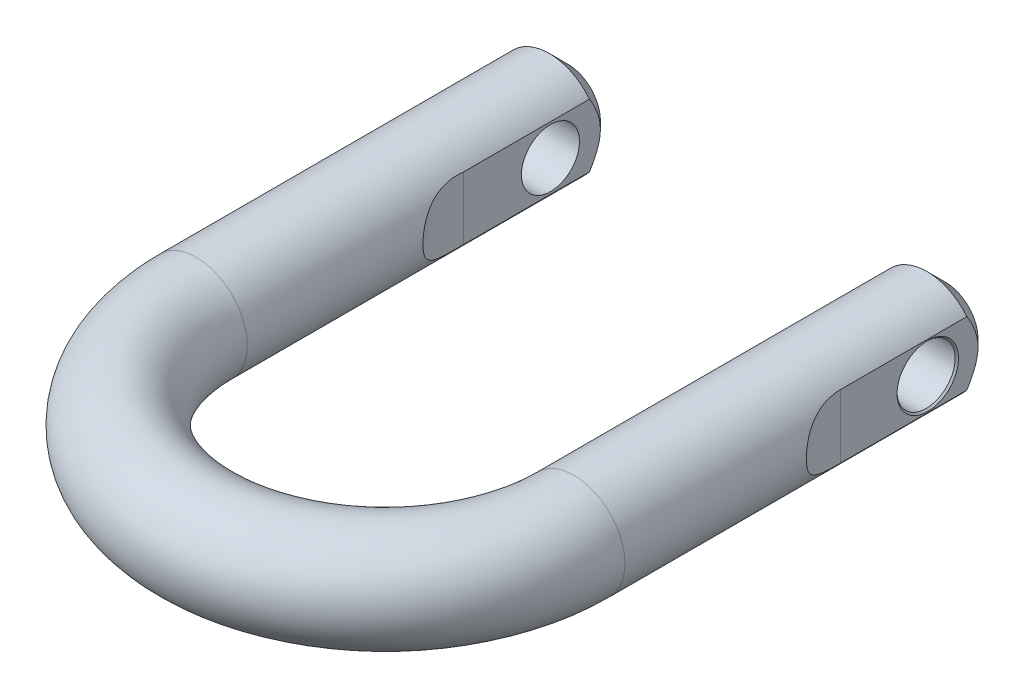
ISO-10303-21;
HEADER;
FILE_DESCRIPTION(('STEP AP214'),'2;1');
FILE_NAME('part.step','',(''),(''),'','','');
FILE_SCHEMA(('AUTOMOTIVE_DESIGN { 1 0 10303 214 1 1 1 1 }'));
ENDSEC;
DATA;
#1=APPLICATION_CONTEXT('core data for automotive mechanical design processes');
#2=APPLICATION_PROTOCOL_DEFINITION('international standard','automotive_design',2000,#1);
#3=PRODUCT_CONTEXT('',#1,'mechanical');
#4=PRODUCT('Part','Part','',(#3));
#5=PRODUCT_RELATED_PRODUCT_CATEGORY('part','',(#4));
#6=PRODUCT_DEFINITION_FORMATION('','',#4);
#7=PRODUCT_DEFINITION_CONTEXT('part definition',#1,'design');
#8=PRODUCT_DEFINITION('design','',#6,#7);
#9=PRODUCT_DEFINITION_SHAPE('','',#8);
#10=(LENGTH_UNIT() NAMED_UNIT(*) SI_UNIT(.MILLI.,.METRE.));
#11=(NAMED_UNIT(*) PLANE_ANGLE_UNIT() SI_UNIT($,.RADIAN.));
#12=(NAMED_UNIT(*) SI_UNIT($,.STERADIAN.) SOLID_ANGLE_UNIT());
#13=UNCERTAINTY_MEASURE_WITH_UNIT(LENGTH_MEASURE(1.E-05),#10,'distance_accuracy_value','');
#14=(GEOMETRIC_REPRESENTATION_CONTEXT(3) GLOBAL_UNCERTAINTY_ASSIGNED_CONTEXT((#13)) GLOBAL_UNIT_ASSIGNED_CONTEXT((#10,
#11,#12)) REPRESENTATION_CONTEXT('',''));
#15=CARTESIAN_POINT('',(0.,0.,0.));
#16=DIRECTION('',(0.,0.,1.));
#17=DIRECTION('',(1.,0.,0.));
#18=AXIS2_PLACEMENT_3D('',#15,#16,#17);
#19=CARTESIAN_POINT('',(59.0296,0.,0.));
#20=DIRECTION('',(1.,0.,0.));
#21=DIRECTION('',(0.,0.,1.));
#22=AXIS2_PLACEMENT_3D('',#19,#20,#21);
#23=CONICAL_SURFACE('',#22,7.9375,0.785398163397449);
#24=CARTESIAN_POINT('',(58.5921,0.,0.));
#25=DIRECTION('',(1.,0.,0.));
#26=DIRECTION('',(0.,0.,1.));
#27=AXIS2_PLACEMENT_3D('',#24,#25,#26);
#28=CIRCLE('',#27,7.5);
#29=CARTESIAN_POINT('',(58.5921,0.,7.5));
#30=VERTEX_POINT('',#29);
#31=EDGE_CURVE('E271',#30,#30,#28,.F.);
#32=ORIENTED_EDGE('',*,*,#31,.T.);
#33=EDGE_LOOP('',(#32));
#34=FACE_BOUND('',#33,.T.);
#35=CARTESIAN_POINT('',(59.0296,0.,0.));
#36=DIRECTION('',(1.,0.,0.));
#37=DIRECTION('',(0.,0.,1.));
#38=AXIS2_PLACEMENT_3D('',#35,#36,#37);
#39=CIRCLE('',#38,7.9375);
#40=CARTESIAN_POINT('',(59.0296,0.,7.9375));
#41=VERTEX_POINT('',#40);
#42=EDGE_CURVE('E139',#41,#41,#39,.T.);
#43=ORIENTED_EDGE('',*,*,#42,.T.);
#44=EDGE_LOOP('',(#43));
#45=FACE_BOUND('',#44,.T.);
#46=ADVANCED_FACE('F14',(#34,#45),#23,.F.);
#47=CARTESIAN_POINT('',(48.7426,0.,-14.83995));
#48=DIRECTION('',(0.,0.,1.));
#49=DIRECTION('',(0.,-1.,0.));
#50=AXIS2_PLACEMENT_3D('',#47,#48,#49);
#51=PLANE('',#50);
#52=CARTESIAN_POINT('',(48.7426,0.,-14.83995));
#53=DIRECTION('',(0.,0.,1.));
#54=DIRECTION('',(-1.,0.,0.));
#55=AXIS2_PLACEMENT_3D('',#52,#53,#54);
#56=CIRCLE('',#55,8.4074);
#57=CARTESIAN_POINT('',(40.3352,0.,-14.83995));
#58=VERTEX_POINT('',#57);
#59=EDGE_CURVE('E136',#58,#58,#56,.T.);
#60=ORIENTED_EDGE('',*,*,#59,.F.);
#61=EDGE_LOOP('',(#60));
#62=FACE_BOUND('',#61,.T.);
#63=ADVANCED_FACE('F239',(#62),#51,.F.);
#64=CARTESIAN_POINT('',(-48.7426,0.,-14.83995));
#65=DIRECTION('',(0.,0.,-1.));
#66=DIRECTION('',(1.,0.,0.));
#67=AXIS2_PLACEMENT_3D('',#64,#65,#66);
#68=PLANE('',#67);
#69=CARTESIAN_POINT('',(-48.7426,0.,-14.83995));
#70=DIRECTION('',(0.,0.,1.));
#71=DIRECTION('',(0.,-1.,0.));
#72=AXIS2_PLACEMENT_3D('',#69,#70,#71);
#73=CIRCLE('',#72,8.4074);
#74=CARTESIAN_POINT('',(-48.7426,-8.4074,-14.83995));
#75=VERTEX_POINT('',#74);
#76=EDGE_CURVE('E438',#75,#75,#73,.T.);
#77=ORIENTED_EDGE('',*,*,#76,.F.);
#78=EDGE_LOOP('',(#77));
#79=FACE_BOUND('',#78,.T.);
#80=ADVANCED_FACE('F236',(#79),#68,.T.);
#81=CARTESIAN_POINT('',(-59.0296,0.,0.));
#82=DIRECTION('',(-1.,0.,0.));
#83=DIRECTION('',(0.,0.,-1.));
#84=AXIS2_PLACEMENT_3D('',#81,#82,#83);
#85=CONICAL_SURFACE('',#84,7.9375,0.785398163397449);
#86=CARTESIAN_POINT('',(-58.5921,0.,0.));
#87=DIRECTION('',(-1.,0.,0.));
#88=DIRECTION('',(0.,0.,-1.));
#89=AXIS2_PLACEMENT_3D('',#86,#87,#88);
#90=CIRCLE('',#89,7.5);
#91=CARTESIAN_POINT('',(-58.5921,0.,-7.49999999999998));
#92=VERTEX_POINT('',#91);
#93=EDGE_CURVE('E270',#92,#92,#90,.F.);
#94=ORIENTED_EDGE('',*,*,#93,.T.);
#95=EDGE_LOOP('',(#94));
#96=FACE_BOUND('',#95,.T.);
#97=CARTESIAN_POINT('',(-59.0296,0.,0.));
#98=DIRECTION('',(-1.,0.,0.));
#99=DIRECTION('',(0.,0.,-1.));
#100=AXIS2_PLACEMENT_3D('',#97,#98,#99);
#101=CIRCLE('',#100,7.9375);
#102=CARTESIAN_POINT('',(-59.0296,0.,-7.93749999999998));
#103=VERTEX_POINT('',#102);
#104=EDGE_CURVE('E116',#103,#103,#101,.T.);
#105=ORIENTED_EDGE('',*,*,#104,.T.);
#106=EDGE_LOOP('',(#105));
#107=FACE_BOUND('',#106,.T.);
#108=ADVANCED_FACE('F232',(#96,#107),#85,.F.);
#109=CARTESIAN_POINT('',(84.4296,25.4,22.49805));
#110=DIRECTION('',(0.,-1.,0.));
#111=DIRECTION('',(1.,0.,0.));
#112=AXIS2_PLACEMENT_3D('',#109,#110,#111);
#113=CYLINDRICAL_SURFACE('',#112,25.4);
#114=DIRECTION('',(0.,-1.,0.));
#115=VECTOR('',#114,1.);
#116=CARTESIAN_POINT('',(59.0296,25.4,22.49805));
#117=LINE('',#116,#115);
#118=CARTESIAN_POINT('',(59.0296,-8.22337503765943,22.49805));
#119=VERTEX_POINT('',#118);
#120=CARTESIAN_POINT('',(59.0296,8.22337503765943,22.49805));
#121=VERTEX_POINT('',#120);
#122=EDGE_CURVE('E137',#119,#121,#117,.F.);
#123=ORIENTED_EDGE('',*,*,#122,.T.);
#124=CARTESIAN_POINT('',(59.0296,-8.22337503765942,22.49805));
#125=CARTESIAN_POINT('',(59.0295964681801,-8.22336756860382,22.7016537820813));
#126=CARTESIAN_POINT('',(59.0320480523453,-8.22031233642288,22.9052572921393));
#127=CARTESIAN_POINT('',(59.0418354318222,-8.20805265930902,23.3121642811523));
#128=CARTESIAN_POINT('',(59.0491712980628,-8.1988481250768,23.5154677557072));
#129=CARTESIAN_POINT('',(59.0687103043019,-8.17422470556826,23.9216581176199));
#130=CARTESIAN_POINT('',(59.0809179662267,-8.15880004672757,24.124544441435));
#131=CARTESIAN_POINT('',(59.1101429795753,-8.12162950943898,24.5293807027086));
#132=CARTESIAN_POINT('',(59.1271604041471,-8.09988353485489,24.7313306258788));
#133=CARTESIAN_POINT('',(59.185664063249,-8.0245164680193,25.338831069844));
#134=CARTESIAN_POINT('',(59.2344321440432,-7.96097243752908,25.7425280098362));
#135=CARTESIAN_POINT('',(59.3502878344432,-7.80593343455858,26.5416896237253));
#136=CARTESIAN_POINT('',(59.4173674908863,-7.71445059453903,26.9371577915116));
#137=CARTESIAN_POINT('',(59.5523510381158,-7.52370289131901,27.6342553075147));
#138=CARTESIAN_POINT('',(59.6170905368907,-7.43015935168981,27.938067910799));
#139=CARTESIAN_POINT('',(59.7559004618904,-7.22281540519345,28.5364953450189));
#140=CARTESIAN_POINT('',(59.8299689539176,-7.10901919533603,28.8311120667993));
#141=CARTESIAN_POINT('',(59.9857406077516,-6.85999676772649,29.4079500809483));
#142=CARTESIAN_POINT('',(60.0674194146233,-6.72483801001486,29.6902069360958));
#143=CARTESIAN_POINT('',(60.2366804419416,-6.431258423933,30.2404921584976));
#144=CARTESIAN_POINT('',(60.3242607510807,-6.27284510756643,30.5085250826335));
#145=CARTESIAN_POINT('',(60.4794557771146,-5.97600882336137,30.9592355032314));
#146=CARTESIAN_POINT('',(60.5462963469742,-5.84320614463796,31.1458915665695));
#147=CARTESIAN_POINT('',(60.6806054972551,-5.56366273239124,31.5081860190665));
#148=CARTESIAN_POINT('',(60.748073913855,-5.41692554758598,31.6838271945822));
#149=CARTESIAN_POINT('',(60.8822022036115,-5.10924960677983,32.0223970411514));
#150=CARTESIAN_POINT('',(60.948862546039,-4.94831959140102,32.1853334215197));
#151=CARTESIAN_POINT('',(61.079774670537,-4.61226373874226,32.4967613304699));
#152=CARTESIAN_POINT('',(61.1440268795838,-4.4371404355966,32.6452554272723));
#153=CARTESIAN_POINT('',(61.3081708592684,-3.95624336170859,33.0157817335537));
#154=CARTESIAN_POINT('',(61.404632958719,-3.63842599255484,33.2242520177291));
#155=CARTESIAN_POINT('',(61.5346338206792,-3.13689898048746,33.4976323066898));
#156=CARTESIAN_POINT('',(61.5755306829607,-2.96552429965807,33.5822280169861));
#157=CARTESIAN_POINT('',(61.651448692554,-2.61532318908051,33.7374120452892));
#158=CARTESIAN_POINT('',(61.686472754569,-2.43650051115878,33.8080073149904));
#159=CARTESIAN_POINT('',(61.7492534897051,-2.07517973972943,33.9333786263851));
#160=CARTESIAN_POINT('',(61.7771093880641,-1.89277426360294,33.9883718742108));
#161=CARTESIAN_POINT('',(61.8254585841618,-1.52309374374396,34.0831968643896));
#162=CARTESIAN_POINT('',(61.8459519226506,-1.33581872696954,34.1230286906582));
#163=CARTESIAN_POINT('',(61.87898110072,-0.957971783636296,34.1869715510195));
#164=CARTESIAN_POINT('',(61.8915196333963,-0.767400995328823,34.211087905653));
#165=CARTESIAN_POINT('',(61.9082784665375,-0.384549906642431,34.2432793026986));
#166=CARTESIAN_POINT('',(61.9124993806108,-0.192269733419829,34.2513555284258));
#167=CARTESIAN_POINT('',(61.9125005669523,0.17599235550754,34.2513568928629));
#168=CARTESIAN_POINT('',(61.908965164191,0.351975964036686,34.2445914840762));
#169=CARTESIAN_POINT('',(61.8949139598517,0.702629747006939,34.2176130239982));
#170=CARTESIAN_POINT('',(61.8843981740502,0.877299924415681,34.1974000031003));
#171=CARTESIAN_POINT('',(61.8566482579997,1.22403112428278,34.1437683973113));
#172=CARTESIAN_POINT('',(61.8394149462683,1.39609246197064,34.1103514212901));
#173=CARTESIAN_POINT('',(61.7986475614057,1.73645389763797,34.0306988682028));
#174=CARTESIAN_POINT('',(61.7751133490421,1.90475391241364,33.9844630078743));
#175=CARTESIAN_POINT('',(61.7223863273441,2.23593806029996,33.8798713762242));
#176=CARTESIAN_POINT('',(61.6932145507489,2.39883976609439,33.821560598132));
#177=CARTESIAN_POINT('',(61.6298007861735,2.71900769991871,33.693329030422));
#178=CARTESIAN_POINT('',(61.5955570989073,2.87627201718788,33.6234043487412));
#179=CARTESIAN_POINT('',(61.4862805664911,3.33838864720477,33.397229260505));
#180=CARTESIAN_POINT('',(61.4046644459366,3.63379258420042,33.2245047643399));
#181=CARTESIAN_POINT('',(61.2211907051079,4.22327185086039,32.8219692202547));
#182=CARTESIAN_POINT('',(61.1181209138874,4.51419394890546,32.5881523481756));
#183=CARTESIAN_POINT('',(60.9057951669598,5.05850041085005,32.0827076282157));
#184=CARTESIAN_POINT('',(60.7965357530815,5.31186349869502,31.8110585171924));
#185=CARTESIAN_POINT('',(60.6031548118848,5.72831891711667,31.3024271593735));
#186=CARTESIAN_POINT('',(60.5189331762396,5.89887114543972,31.0714868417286));
#187=CARTESIAN_POINT('',(60.3531804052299,6.21877454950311,30.594332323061));
#188=CARTESIAN_POINT('',(60.2716504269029,6.36811669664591,30.3481116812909));
#189=CARTESIAN_POINT('',(60.1131665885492,6.64697472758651,29.8425332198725));
#190=CARTESIAN_POINT('',(60.0362239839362,6.77644298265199,29.5831457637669));
#191=CARTESIAN_POINT('',(59.8887294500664,7.0164004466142,29.0540507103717));
#192=CARTESIAN_POINT('',(59.8181773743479,7.12689009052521,28.784343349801));
#193=CARTESIAN_POINT('',(59.6625786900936,7.36387427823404,28.1456552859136));
#194=CARTESIAN_POINT('',(59.5804816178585,7.48353010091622,27.7734075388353));
#195=CARTESIAN_POINT('',(59.431986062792,7.69414462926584,27.0177563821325));
#196=CARTESIAN_POINT('',(59.3655943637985,7.78509093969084,26.6343482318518));
#197=CARTESIAN_POINT('',(59.2500353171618,7.9403663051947,25.8599943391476));
#198=CARTESIAN_POINT('',(59.2008544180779,8.00471630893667,25.4690547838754));
#199=CARTESIAN_POINT('',(59.1205977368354,8.10849752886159,24.682240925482));
#200=CARTESIAN_POINT('',(59.0895128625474,8.14794125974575,24.286369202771));
#201=CARTESIAN_POINT('',(59.0550240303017,8.1914933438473,23.657673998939));
#202=CARTESIAN_POINT('',(59.0454825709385,8.20347754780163,23.4256854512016));
#203=CARTESIAN_POINT('',(59.0327762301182,8.21940263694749,22.9618207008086));
#204=CARTESIAN_POINT('',(59.0295959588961,8.2233629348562,22.7299455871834));
#205=CARTESIAN_POINT('',(59.0296,8.22337503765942,22.49805));
#206=B_SPLINE_CURVE_WITH_KNOTS('',3,(#124,#125,#126,#127,#128,#129,#130,#131,#132,#133,#134,
#135,#136,#137,#138,#139,#140,#141,#142,#143,#144,#145,#146,#147,#148,#149,#150,#151,#152,#153,
#154,#155,#156,#157,#158,#159,#160,#161,#162,#163,#164,#165,#166,#167,#168,#169,#170,#171,#172,
#173,#174,#175,#176,#177,#178,#179,#180,#181,#182,#183,#184,#185,#186,#187,#188,#189,#190,#191,
#192,#193,#194,#195,#196,#197,#198,#199,#200,#201,#202,#203,#204,#205),.UNSPECIFIED.,.F.,.F.,(4,
2,2,2,2,2,2,2,2,2,2,2,2,2,2,2,2,2,2,2,2,2,2,2,2,2,2,2,2,2,2,2,2,2,2,2,2,2,2,2,4),(0.,
0.610772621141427,1.22155411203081,1.83290384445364,2.44426287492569,3.67749443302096,
4.91019121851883,5.88261871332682,6.85484492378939,7.82406015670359,8.79296298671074,
9.50826502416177,10.2233853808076,10.9380683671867,11.6526240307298,12.8232855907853,
13.4090341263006,13.9944910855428,14.5713453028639,15.1481963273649,15.7248519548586,
16.301465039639,16.8292625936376,17.3570589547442,17.8847910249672,18.4125347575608,
18.9383463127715,19.4643344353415,20.5155915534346,21.6731225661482,22.8313068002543,
23.7277165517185,24.6245067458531,25.5234136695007,26.4222999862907,27.6192046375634,
28.8166253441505,30.0131010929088,31.2089751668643,31.9062534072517,32.6018426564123),.UNSPECIFIED.);
#207=EDGE_CURVE('E181',#119,#121,#206,.T.);
#208=ORIENTED_EDGE('',*,*,#207,.F.);
#209=EDGE_LOOP('',(#123,#208));
#210=FACE_BOUND('',#209,.T.);
#211=ADVANCED_FACE('F227',(#210),#113,.F.);
#212=CARTESIAN_POINT('',(59.0296,25.4,-35.3090993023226));
#213=DIRECTION('',(-1.,0.,0.));
#214=DIRECTION('',(0.,0.,-1.));
#215=AXIS2_PLACEMENT_3D('',#212,#213,#214);
#216=PLANE('',#215);
#217=DIRECTION('',(0.,0.,-1.));
#218=VECTOR('',#217,1.);
#219=CARTESIAN_POINT('',(59.0296,-8.22337503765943,81.05775));
#220=LINE('',#219,#218);
#221=CARTESIAN_POINT('',(59.0296,-8.22337503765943,-10.07745));
#222=VERTEX_POINT('',#221);
#223=EDGE_CURVE('E105',#222,#119,#220,.F.);
#224=ORIENTED_EDGE('',*,*,#223,.F.);
#225=CARTESIAN_POINT('',(59.0296,8.22337503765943,-10.07745));
#226=CARTESIAN_POINT('',(59.0296,8.02526383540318,-10.2011338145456));
#227=CARTESIAN_POINT('',(59.0296,7.82593146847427,-10.3228883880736));
#228=CARTESIAN_POINT('',(59.0296,7.4245403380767,-10.5619235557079));
#229=CARTESIAN_POINT('',(59.0296,7.22248093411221,-10.679203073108));
#230=CARTESIAN_POINT('',(59.0296,6.81459284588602,-10.9090938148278));
#231=CARTESIAN_POINT('',(59.0296,6.6087519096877,-11.0216834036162));
#232=CARTESIAN_POINT('',(59.0296,6.19391827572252,-11.2408511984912));
#233=CARTESIAN_POINT('',(59.0296,5.98492577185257,-11.3474297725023));
#234=CARTESIAN_POINT('',(59.0296,5.34349051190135,-11.6614158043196));
#235=CARTESIAN_POINT('',(59.0296,4.90558714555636,-11.857905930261));
#236=CARTESIAN_POINT('',(59.0296,4.01485423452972,-12.2121703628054));
#237=CARTESIAN_POINT('',(59.0296,3.56205090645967,-12.3700089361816));
#238=CARTESIAN_POINT('',(59.0296,2.80100013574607,-12.5897266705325));
#239=CARTESIAN_POINT('',(59.0296,2.49689248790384,-12.6659160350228));
#240=CARTESIAN_POINT('',(59.0296,1.88345085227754,-12.7936494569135));
#241=CARTESIAN_POINT('',(59.0296,1.57411680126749,-12.8451932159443));
#242=CARTESIAN_POINT('',(59.0296,0.95521823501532,-12.9206138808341));
#243=CARTESIAN_POINT('',(59.0296,0.6456875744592,-12.9447648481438));
#244=CARTESIAN_POINT('',(59.0296,0.0257101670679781,-12.9649831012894));
#245=CARTESIAN_POINT('',(59.0296,-0.284736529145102,-12.9610519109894));
#246=CARTESIAN_POINT('',(59.0296,-0.903850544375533,-12.9253435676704));
#247=CARTESIAN_POINT('',(59.0296,-1.21251863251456,-12.8935795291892));
#248=CARTESIAN_POINT('',(59.0296,-1.82601712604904,-12.8039529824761));
#249=CARTESIAN_POINT('',(59.0296,-2.1308471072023,-12.7460876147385));
#250=CARTESIAN_POINT('',(59.0296,-2.73799233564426,-12.6063546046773));
#251=CARTESIAN_POINT('',(59.0296,-3.04025470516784,-12.5242601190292));
#252=CARTESIAN_POINT('',(59.0296,-3.63837827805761,-12.3395912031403));
#253=CARTESIAN_POINT('',(59.0296,-3.9342394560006,-12.2370166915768));
#254=CARTESIAN_POINT('',(59.0296,-4.580830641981,-11.9912817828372));
#255=CARTESIAN_POINT('',(59.0296,-4.93003148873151,-11.8441220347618));
#256=CARTESIAN_POINT('',(59.0296,-5.61931704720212,-11.529630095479));
#257=CARTESIAN_POINT('',(59.0296,-5.95939715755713,-11.3622879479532));
#258=CARTESIAN_POINT('',(59.0296,-6.62430275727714,-11.0152201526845));
#259=CARTESIAN_POINT('',(59.0296,-6.94929797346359,-10.8358176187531));
#260=CARTESIAN_POINT('',(59.0296,-7.43120304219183,-10.5576686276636));
#261=CARTESIAN_POINT('',(59.0296,-7.59079347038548,-10.463516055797));
#262=CARTESIAN_POINT('',(59.0296,-7.90830253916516,-10.2724678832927));
#263=CARTESIAN_POINT('',(59.0296,-8.06622135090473,-10.1755725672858));
#264=CARTESIAN_POINT('',(59.0296,-8.22337503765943,-10.07745));
#265=B_SPLINE_CURVE_WITH_KNOTS('',3,(#225,#226,#227,#228,#229,#230,#231,#232,#233,#234,#235,
#236,#237,#238,#239,#240,#241,#242,#243,#244,#245,#246,#247,#248,#249,#250,#251,#252,#253,#254,
#255,#256,#257,#258,#259,#260,#261,#262,#263,#264),.UNSPECIFIED.,.F.,.F.,(4,2,2,2,2,2,2,2,2,2,2,
2,2,2,2,2,2,2,2,4),(0.,0.700659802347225,1.40148713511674,2.10525296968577,2.80897568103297,
4.24749394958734,5.68360386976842,6.6232597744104,7.56292705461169,8.49310778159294,
9.42323803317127,10.3529302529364,11.2827243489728,12.2215157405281,13.1603108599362,
14.2963089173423,15.4328696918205,16.5461943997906,17.1020540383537,17.6578562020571),.UNSPECIFIED.);
#266=CARTESIAN_POINT('',(59.0296,8.22337503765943,-10.07745));
#267=VERTEX_POINT('',#266);
#268=EDGE_CURVE('E138',#267,#222,#265,.T.);
#269=ORIENTED_EDGE('',*,*,#268,.F.);
#270=DIRECTION('',(0.,0.,-1.));
#271=VECTOR('',#270,1.);
#272=CARTESIAN_POINT('',(59.0296,8.22337503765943,81.05775));
#273=LINE('',#272,#271);
#274=EDGE_CURVE('E131',#121,#267,#273,.T.);
#275=ORIENTED_EDGE('',*,*,#274,.F.);
#276=ORIENTED_EDGE('',*,*,#122,.F.);
#277=EDGE_LOOP('',(#224,#269,#275,#276));
#278=FACE_BOUND('',#277,.T.);
#279=ORIENTED_EDGE('',*,*,#42,.F.);
#280=EDGE_LOOP('',(#279));
#281=FACE_BOUND('',#280,.T.);
#282=ADVANCED_FACE('F224',(#278,#281),#216,.F.);
#283=CARTESIAN_POINT('',(48.7426,0.,-10.07745));
#284=DIRECTION('',(0.,0.,1.));
#285=DIRECTION('',(-1.,0.,0.));
#286=AXIS2_PLACEMENT_3D('',#283,#284,#285);
#287=CONICAL_SURFACE('',#286,13.1699,0.78539816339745);
#288=ORIENTED_EDGE('',*,*,#59,.T.);
#289=EDGE_LOOP('',(#288));
#290=FACE_BOUND('',#289,.T.);
#291=CARTESIAN_POINT('',(38.3794,-8.12713675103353,-10.07745));
#292=CARTESIAN_POINT('',(38.3794,-7.93111417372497,-10.1983981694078));
#293=CARTESIAN_POINT('',(38.3794,-7.73388385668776,-10.3174155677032));
#294=CARTESIAN_POINT('',(38.3794,-7.33673633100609,-10.5509844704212));
#295=CARTESIAN_POINT('',(38.3794,-7.13681849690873,-10.665534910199));
#296=CARTESIAN_POINT('',(38.3794,-6.73330326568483,-10.8899603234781));
#297=CARTESIAN_POINT('',(38.3794,-6.52969426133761,-10.9998145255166));
#298=CARTESIAN_POINT('',(38.3794,-6.11939103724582,-11.2135548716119));
#299=CARTESIAN_POINT('',(38.3794,-5.91269700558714,-11.3174413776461));
#300=CARTESIAN_POINT('',(38.3794,-5.27887907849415,-11.6230960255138));
#301=CARTESIAN_POINT('',(38.3794,-4.84644365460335,-11.8140857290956));
#302=CARTESIAN_POINT('',(38.3794,-3.96716928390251,-12.1581049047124));
#303=CARTESIAN_POINT('',(38.3794,-3.52035454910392,-12.3111947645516));
#304=CARTESIAN_POINT('',(38.3794,-2.76395291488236,-12.525823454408));
#305=CARTESIAN_POINT('',(38.3794,-2.45820837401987,-12.6008732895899));
#306=CARTESIAN_POINT('',(38.3794,-1.8415787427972,-12.7261195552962));
#307=CARTESIAN_POINT('',(38.3794,-1.53069360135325,-12.7763157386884));
#308=CARTESIAN_POINT('',(38.3794,-0.908724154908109,-12.8489231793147));
#309=CARTESIAN_POINT('',(38.3794,-0.597671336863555,-12.871600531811));
#310=CARTESIAN_POINT('',(38.3794,0.0252108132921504,-12.888795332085));
#311=CARTESIAN_POINT('',(38.3794,0.337040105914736,-12.8833141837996));
#312=CARTESIAN_POINT('',(38.3794,0.958694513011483,-12.8445231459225));
#313=CARTESIAN_POINT('',(38.3794,1.26852097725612,-12.8112345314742));
#314=CARTESIAN_POINT('',(38.3794,1.88423735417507,-12.718648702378));
#315=CARTESIAN_POINT('',(38.3794,2.19012683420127,-12.6593486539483));
#316=CARTESIAN_POINT('',(38.3794,2.79921745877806,-12.5168803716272));
#317=CARTESIAN_POINT('',(38.3794,3.10236739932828,-12.433495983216));
#318=CARTESIAN_POINT('',(38.3794,3.70224539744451,-12.2463830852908));
#319=CARTESIAN_POINT('',(38.3794,3.99897343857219,-12.1426545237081));
#320=CARTESIAN_POINT('',(38.3794,4.63110074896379,-11.9007632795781));
#321=CARTESIAN_POINT('',(38.3794,4.96540460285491,-11.7597571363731));
#322=CARTESIAN_POINT('',(38.3794,5.62568955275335,-11.4593132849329));
#323=CARTESIAN_POINT('',(38.3794,5.95166727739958,-11.2998682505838));
#324=CARTESIAN_POINT('',(38.3794,6.58975037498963,-10.9694156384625));
#325=CARTESIAN_POINT('',(38.3794,6.90200191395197,-10.7986886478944));
#326=CARTESIAN_POINT('',(38.3794,7.36522804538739,-10.5341091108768));
#327=CARTESIAN_POINT('',(38.3794,7.51868555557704,-10.444558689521));
#328=CARTESIAN_POINT('',(38.3794,7.82404597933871,-10.2628756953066));
#329=CARTESIAN_POINT('',(38.3794,7.9759490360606,-10.1707433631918));
#330=CARTESIAN_POINT('',(38.3794,8.12713675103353,-10.07745));
#331=B_SPLINE_CURVE_WITH_KNOTS('',3,(#291,#292,#293,#294,#295,#296,#297,#298,#299,#300,#301,
#302,#303,#304,#305,#306,#307,#308,#309,#310,#311,#312,#313,#314,#315,#316,#317,#318,#319,#320,
#321,#322,#323,#324,#325,#326,#327,#328,#329,#330),.UNSPECIFIED.,.F.,.F.,(4,2,2,2,2,2,2,2,2,2,2,
2,2,2,2,2,2,2,2,4),(0.,0.691007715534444,1.38217913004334,2.07614447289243,2.77006767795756,
4.18691184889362,5.601483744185,6.54507035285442,7.48866634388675,8.42306354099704,
9.35741415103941,10.2910505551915,11.2247886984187,12.1671822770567,13.1095782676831,
14.1973456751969,15.2855467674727,16.3528661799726,16.8858715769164,17.4188274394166),.UNSPECIFIED.);
#332=CARTESIAN_POINT('',(38.3794,-8.12713675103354,-10.07745));
#333=VERTEX_POINT('',#332);
#334=CARTESIAN_POINT('',(38.3794,8.12713675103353,-10.07745));
#335=VERTEX_POINT('',#334);
#336=EDGE_CURVE('E124',#333,#335,#331,.T.);
#337=ORIENTED_EDGE('',*,*,#336,.T.);
#338=CARTESIAN_POINT('',(48.7426,0.,-10.07745));
#339=DIRECTION('',(0.,0.,-1.));
#340=DIRECTION('',(1.,0.,0.));
#341=AXIS2_PLACEMENT_3D('',#338,#339,#340);
#342=CIRCLE('',#341,13.1699);
#343=EDGE_CURVE('E127',#267,#335,#342,.F.);
#344=ORIENTED_EDGE('',*,*,#343,.F.);
#345=ORIENTED_EDGE('',*,*,#268,.T.);
#346=CARTESIAN_POINT('',(48.7426,0.,-10.07745));
#347=DIRECTION('',(0.,0.,-1.));
#348=DIRECTION('',(1.,0.,0.));
#349=AXIS2_PLACEMENT_3D('',#346,#347,#348);
#350=CIRCLE('',#349,13.1699);
#351=EDGE_CURVE('E102',#333,#222,#350,.F.);
#352=ORIENTED_EDGE('',*,*,#351,.F.);
#353=EDGE_LOOP('',(#337,#344,#345,#352));
#354=FACE_BOUND('',#353,.T.);
#355=ADVANCED_FACE('F202',(#290,#354),#287,.T.);
#356=CARTESIAN_POINT('',(38.3794,25.4,-35.6582064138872));
#357=DIRECTION('',(1.,0.,0.));
#358=DIRECTION('',(0.,1.,0.));
#359=AXIS2_PLACEMENT_3D('',#356,#357,#358);
#360=PLANE('',#359);
#361=CARTESIAN_POINT('',(38.3794,0.,0.));
#362=DIRECTION('',(1.,0.,0.));
#363=DIRECTION('',(0.,1.,0.));
#364=AXIS2_PLACEMENT_3D('',#361,#362,#363);
#365=CIRCLE('',#364,7.5);
#366=CARTESIAN_POINT('',(38.3794,7.5,0.));
#367=VERTEX_POINT('',#366);
#368=EDGE_CURVE('E272',#367,#367,#365,.T.);
#369=ORIENTED_EDGE('',*,*,#368,.T.);
#370=EDGE_LOOP('',(#369));
#371=FACE_BOUND('',#370,.T.);
#372=DIRECTION('',(0.,0.,-1.));
#373=VECTOR('',#372,1.);
#374=CARTESIAN_POINT('',(38.3794,-8.12713675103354,81.05775));
#375=LINE('',#374,#373);
#376=CARTESIAN_POINT('',(38.3794,-8.12713675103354,22.49805));
#377=VERTEX_POINT('',#376);
#378=EDGE_CURVE('E120',#377,#333,#375,.T.);
#379=ORIENTED_EDGE('',*,*,#378,.F.);
#380=DIRECTION('',(0.,1.,0.));
#381=VECTOR('',#380,1.);
#382=CARTESIAN_POINT('',(38.3794,25.4,22.49805));
#383=LINE('',#382,#381);
#384=CARTESIAN_POINT('',(38.3794,8.12713675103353,22.49805));
#385=VERTEX_POINT('',#384);
#386=EDGE_CURVE('E134',#385,#377,#383,.F.);
#387=ORIENTED_EDGE('',*,*,#386,.F.);
#388=DIRECTION('',(0.,0.,-1.));
#389=VECTOR('',#388,1.);
#390=CARTESIAN_POINT('',(38.3794,8.12713675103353,81.05775));
#391=LINE('',#390,#389);
#392=EDGE_CURVE('E130',#335,#385,#391,.F.);
#393=ORIENTED_EDGE('',*,*,#392,.F.);
#394=ORIENTED_EDGE('',*,*,#336,.F.);
#395=EDGE_LOOP('',(#379,#387,#393,#394));
#396=FACE_BOUND('',#395,.T.);
#397=ADVANCED_FACE('F197',(#371,#396),#360,.F.);
#398=CARTESIAN_POINT('',(13.0251612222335,25.4,24.02205));
#399=DIRECTION('',(0.,-1.,0.));
#400=DIRECTION('',(1.,0.,0.));
#401=AXIS2_PLACEMENT_3D('',#398,#399,#400);
#402=CYLINDRICAL_SURFACE('',#401,25.4);
#403=CARTESIAN_POINT('',(38.3794,8.12713675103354,22.49805));
#404=CARTESIAN_POINT('',(38.3946115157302,8.14650683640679,22.7510065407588));
#405=CARTESIAN_POINT('',(38.4060443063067,8.16100064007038,23.0045356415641));
#406=CARTESIAN_POINT('',(38.4213274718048,8.18033338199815,23.5127176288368));
#407=CARTESIAN_POINT('',(38.4251620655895,8.18515222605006,23.7673717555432));
#408=CARTESIAN_POINT('',(38.4251598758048,8.18515319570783,24.4286471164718));
#409=CARTESIAN_POINT('',(38.415382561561,8.17287221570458,24.8353057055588));
#410=CARTESIAN_POINT('',(38.3764249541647,8.12340255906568,25.6463530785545));
#411=CARTESIAN_POINT('',(38.3472351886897,8.0862017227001,26.0507406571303));
#412=CARTESIAN_POINT('',(38.2699269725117,7.9858255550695,26.8549147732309));
#413=CARTESIAN_POINT('',(38.22178875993,7.92262310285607,27.2546960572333));
#414=CARTESIAN_POINT('',(38.1075412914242,7.76859197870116,28.0462210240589));
#415=CARTESIAN_POINT('',(38.0414382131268,7.67777280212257,28.4379674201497));
#416=CARTESIAN_POINT('',(37.9082257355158,7.48819255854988,29.1299097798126));
#417=CARTESIAN_POINT('',(37.8441749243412,7.39499558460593,29.4322262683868));
#418=CARTESIAN_POINT('',(37.7068230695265,7.18841438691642,30.0277889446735));
#419=CARTESIAN_POINT('',(37.6335218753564,7.07502983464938,30.3210349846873));
#420=CARTESIAN_POINT('',(37.4792507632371,6.82675271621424,30.8956115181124));
#421=CARTESIAN_POINT('',(37.3982939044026,6.69189651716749,31.1769611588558));
#422=CARTESIAN_POINT('',(37.2305220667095,6.39896950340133,31.7254687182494));
#423=CARTESIAN_POINT('',(37.1437089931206,6.24090621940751,31.9926312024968));
#424=CARTESIAN_POINT('',(36.9899571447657,5.94488474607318,32.4416228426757));
#425=CARTESIAN_POINT('',(36.9237874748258,5.81255065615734,32.6274339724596));
#426=CARTESIAN_POINT('',(36.7908304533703,5.53401234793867,32.9880898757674));
#427=CARTESIAN_POINT('',(36.7240432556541,5.38781150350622,33.1629372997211));
#428=CARTESIAN_POINT('',(36.5912879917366,5.08131016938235,33.4999420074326));
#429=CARTESIAN_POINT('',(36.5253193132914,4.92102104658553,33.6621093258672));
#430=CARTESIAN_POINT('',(36.3957729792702,4.5863275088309,33.9720630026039));
#431=CARTESIAN_POINT('',(36.3321948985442,4.41192562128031,34.1198519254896));
#432=CARTESIAN_POINT('',(36.1697895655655,3.93305270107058,34.4885976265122));
#433=CARTESIAN_POINT('',(36.0743634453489,3.6166090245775,34.6960511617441));
#434=CARTESIAN_POINT('',(35.945786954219,3.11729853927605,34.9680573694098));
#435=CARTESIAN_POINT('',(35.9053437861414,2.94669101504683,35.0522193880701));
#436=CARTESIAN_POINT('',(35.8302801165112,2.59807182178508,35.2065881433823));
#437=CARTESIAN_POINT('',(35.7956567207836,2.42006388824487,35.2768018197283));
#438=CARTESIAN_POINT('',(35.7336759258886,2.06078682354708,35.4013352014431));
#439=CARTESIAN_POINT('',(35.706206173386,1.87962280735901,35.4559022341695));
#440=CARTESIAN_POINT('',(35.6585285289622,1.51247929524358,35.549993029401));
#441=CARTESIAN_POINT('',(35.638320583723,1.32649983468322,35.589516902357));
#442=CARTESIAN_POINT('',(35.6057514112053,0.951276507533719,35.652966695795));
#443=CARTESIAN_POINT('',(35.5933877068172,0.762033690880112,35.6768975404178));
#444=CARTESIAN_POINT('',(35.5768625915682,0.381857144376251,35.7088414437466));
#445=CARTESIAN_POINT('',(35.5727005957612,0.190923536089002,35.7168556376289));
#446=CARTESIAN_POINT('',(35.5726994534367,-0.175157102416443,35.716856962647));
#447=CARTESIAN_POINT('',(35.5762013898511,-0.350305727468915,35.7101129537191));
#448=CARTESIAN_POINT('',(35.5901194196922,-0.699295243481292,35.6832202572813));
#449=CARTESIAN_POINT('',(35.6005355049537,-0.873136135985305,35.6630715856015));
#450=CARTESIAN_POINT('',(35.6280216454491,-1.2182199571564,35.6096122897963));
#451=CARTESIAN_POINT('',(35.6450908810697,-1.38946320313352,35.5763032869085));
#452=CARTESIAN_POINT('',(35.6854688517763,-1.72820524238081,35.4969111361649));
#453=CARTESIAN_POINT('',(35.7087777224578,-1.8957039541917,35.4508277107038));
#454=CARTESIAN_POINT('',(35.7609975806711,-2.22530833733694,35.3465863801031));
#455=CARTESIAN_POINT('',(35.7898876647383,-2.38743156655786,35.2884734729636));
#456=CARTESIAN_POINT('',(35.8526865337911,-2.70606975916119,35.1606835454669));
#457=CARTESIAN_POINT('',(35.8865970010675,-2.86258282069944,35.0910026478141));
#458=CARTESIAN_POINT('',(35.9948056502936,-3.32249437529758,34.8656281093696));
#459=CARTESIAN_POINT('',(36.075618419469,-3.61649146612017,34.6935300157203));
#460=CARTESIAN_POINT('',(36.2572966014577,-4.20326293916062,34.2924429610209));
#461=CARTESIAN_POINT('',(36.3593644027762,-4.49289106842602,34.0594549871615));
#462=CARTESIAN_POINT('',(36.5696084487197,-5.03479345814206,33.5558518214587));
#463=CARTESIAN_POINT('',(36.6777880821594,-5.28704670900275,33.2852156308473));
#464=CARTESIAN_POINT('',(36.8692920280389,-5.70180460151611,32.7783918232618));
#465=CARTESIAN_POINT('',(36.9527187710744,-5.87171892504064,32.5482033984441));
#466=CARTESIAN_POINT('',(37.1168933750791,-6.19042472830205,32.0726217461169));
#467=CARTESIAN_POINT('',(37.1976400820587,-6.3392071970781,31.8272220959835));
#468=CARTESIAN_POINT('',(37.354589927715,-6.6170249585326,31.3233322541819));
#469=CARTESIAN_POINT('',(37.4307815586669,-6.74601142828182,31.0648117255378));
#470=CARTESIAN_POINT('',(37.5768159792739,-6.98506469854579,30.5375040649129));
#471=CARTESIAN_POINT('',(37.6466589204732,-7.09513195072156,30.2687171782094));
#472=CARTESIAN_POINT('',(37.8006631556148,-7.33118620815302,29.63223830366));
#473=CARTESIAN_POINT('',(37.8818954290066,-7.45035443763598,29.2612977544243));
#474=CARTESIAN_POINT('',(38.0287733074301,-7.66006133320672,28.5083288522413));
#475=CARTESIAN_POINT('',(38.0944121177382,-7.75058752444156,28.1262957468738));
#476=CARTESIAN_POINT('',(38.2085655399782,-7.90503513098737,27.354916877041));
#477=CARTESIAN_POINT('',(38.2571010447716,-7.96898902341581,26.9655806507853));
#478=CARTESIAN_POINT('',(38.3362150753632,-8.07202877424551,26.1820270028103));
#479=CARTESIAN_POINT('',(38.3668029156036,-8.11112753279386,25.7878122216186));
#480=CARTESIAN_POINT('',(38.4004872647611,-8.15397531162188,25.1644185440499));
#481=CARTESIAN_POINT('',(38.4097405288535,-8.16568274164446,24.9360688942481));
#482=CARTESIAN_POINT('',(38.4220745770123,-8.18126671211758,24.4791631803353));
#483=CARTESIAN_POINT('',(38.4251617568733,-8.18515136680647,24.250607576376));
#484=CARTESIAN_POINT('',(38.4251606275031,-8.18515397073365,23.7678037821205));
#485=CARTESIAN_POINT('',(38.4213392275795,-8.18034991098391,23.5135551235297));
#486=CARTESIAN_POINT('',(38.4060823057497,-8.16104698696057,23.0053535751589));
#487=CARTESIAN_POINT('',(38.3946377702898,-8.14653664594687,22.7514013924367));
#488=CARTESIAN_POINT('',(38.3794,-8.12713675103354,22.49805));
#489=B_SPLINE_CURVE_WITH_KNOTS('',3,(#403,#404,#405,#406,#407,#408,#409,#410,#411,#412,#413,
#414,#415,#416,#417,#418,#419,#420,#421,#422,#423,#424,#425,#426,#427,#428,#429,#430,#431,#432,
#433,#434,#435,#436,#437,#438,#439,#440,#441,#442,#443,#444,#445,#446,#447,#448,#449,#450,#451,
#452,#453,#454,#455,#456,#457,#458,#459,#460,#461,#462,#463,#464,#465,#466,#467,#468,#469,#470,
#471,#472,#473,#474,#475,#476,#477,#478,#479,#480,#481,#482,#483,#484,#485,#486,#487,#488),
.UNSPECIFIED.,.F.,.F.,(4,2,2,2,2,2,2,2,2,2,2,2,2,2,2,2,2,2,2,2,2,2,2,2,2,2,2,2,2,2,2,2,2,2,2,2,
2,2,2,2,2,2,4),(0.,0.76232888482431,1.52623944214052,2.74583254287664,3.96602118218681,
5.18748577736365,6.40853087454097,7.37605348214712,8.34359183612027,9.30950854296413,
10.2751124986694,10.9870897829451,11.6988942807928,12.4101296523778,13.1212379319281,
14.2862041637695,14.8690901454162,15.4516853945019,16.0244876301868,16.5972856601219,
17.1699027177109,17.7424789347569,18.2677719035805,18.7930642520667,19.3182919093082,
19.8435309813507,20.3668397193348,20.8903242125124,21.9365794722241,23.0889147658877,
24.2418953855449,25.1348074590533,26.0280991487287,26.923559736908,27.8189989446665,
29.011286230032,30.2040920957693,31.3954357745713,32.5861606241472,33.2724821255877,
33.9580913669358,34.7207593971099,35.4843308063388),.UNSPECIFIED.);
#490=EDGE_CURVE('E66',#385,#377,#489,.T.);
#491=ORIENTED_EDGE('',*,*,#490,.F.);
#492=ORIENTED_EDGE('',*,*,#386,.T.);
#493=EDGE_LOOP('',(#491,#492));
#494=FACE_BOUND('',#493,.T.);
#495=ADVANCED_FACE('F192',(#494),#402,.F.);
#496=CARTESIAN_POINT('',(-84.4296,25.4,22.49805));
#497=DIRECTION('',(0.,-1.,0.));
#498=DIRECTION('',(1.,0.,0.));
#499=AXIS2_PLACEMENT_3D('',#496,#497,#498);
#500=CYLINDRICAL_SURFACE('',#499,25.4);
#501=DIRECTION('',(0.,-1.,0.));
#502=VECTOR('',#501,1.);
#503=CARTESIAN_POINT('',(-59.0296,25.4,22.49805));
#504=LINE('',#503,#502);
#505=CARTESIAN_POINT('',(-59.0296,8.22337503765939,22.49805));
#506=VERTEX_POINT('',#505);
#507=CARTESIAN_POINT('',(-59.0296,-8.22337503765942,22.49805));
#508=VERTEX_POINT('',#507);
#509=EDGE_CURVE('E99',#506,#508,#504,.T.);
#510=ORIENTED_EDGE('',*,*,#509,.T.);
#511=CARTESIAN_POINT('',(-59.0296,8.2233750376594,22.49805));
#512=CARTESIAN_POINT('',(-59.0295964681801,8.22336756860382,22.7016537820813));
#513=CARTESIAN_POINT('',(-59.0320480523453,8.22031233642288,22.9052572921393));
#514=CARTESIAN_POINT('',(-59.0418354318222,8.20805265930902,23.3121642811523));
#515=CARTESIAN_POINT('',(-59.0491712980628,8.1988481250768,23.5154677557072));
#516=CARTESIAN_POINT('',(-59.0687103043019,8.17422470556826,23.9216581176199));
#517=CARTESIAN_POINT('',(-59.0809179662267,8.15880004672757,24.124544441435));
#518=CARTESIAN_POINT('',(-59.1101429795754,8.12162950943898,24.5293807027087));
#519=CARTESIAN_POINT('',(-59.1271604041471,8.09988353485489,24.7313306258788));
#520=CARTESIAN_POINT('',(-59.185664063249,8.0245164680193,25.3388310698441));
#521=CARTESIAN_POINT('',(-59.2344321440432,7.96097243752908,25.7425280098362));
#522=CARTESIAN_POINT('',(-59.3502878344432,7.80593343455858,26.5416896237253));
#523=CARTESIAN_POINT('',(-59.4173674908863,7.71445059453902,26.9371577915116));
#524=CARTESIAN_POINT('',(-59.5523510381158,7.523702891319,27.6342553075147));
#525=CARTESIAN_POINT('',(-59.6170905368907,7.43015935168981,27.938067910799));
#526=CARTESIAN_POINT('',(-59.7559004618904,7.22281540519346,28.5364953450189));
#527=CARTESIAN_POINT('',(-59.8299689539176,7.10901919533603,28.8311120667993));
#528=CARTESIAN_POINT('',(-59.9857406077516,6.8599967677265,29.4079500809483));
#529=CARTESIAN_POINT('',(-60.0674194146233,6.72483801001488,29.6902069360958));
#530=CARTESIAN_POINT('',(-60.2366804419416,6.43125842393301,30.2404921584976));
#531=CARTESIAN_POINT('',(-60.3242607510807,6.27284510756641,30.5085250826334));
#532=CARTESIAN_POINT('',(-60.4794557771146,5.97600882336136,30.9592355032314));
#533=CARTESIAN_POINT('',(-60.5462963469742,5.84320614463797,31.1458915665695));
#534=CARTESIAN_POINT('',(-60.6806054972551,5.56366273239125,31.5081860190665));
#535=CARTESIAN_POINT('',(-60.748073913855,5.41692554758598,31.6838271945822));
#536=CARTESIAN_POINT('',(-60.8822022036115,5.10924960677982,32.0223970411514));
#537=CARTESIAN_POINT('',(-60.948862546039,4.94831959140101,32.1853334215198));
#538=CARTESIAN_POINT('',(-61.079774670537,4.61226373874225,32.4967613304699));
#539=CARTESIAN_POINT('',(-61.1440268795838,4.43714043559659,32.6452554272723));
#540=CARTESIAN_POINT('',(-61.3081708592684,3.95624336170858,33.0157817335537));
#541=CARTESIAN_POINT('',(-61.404632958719,3.63842599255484,33.2242520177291));
#542=CARTESIAN_POINT('',(-61.5346338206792,3.13689898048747,33.4976323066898));
#543=CARTESIAN_POINT('',(-61.5755306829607,2.96552429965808,33.5822280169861));
#544=CARTESIAN_POINT('',(-61.651448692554,2.61532318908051,33.7374120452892));
#545=CARTESIAN_POINT('',(-61.686472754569,2.43650051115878,33.8080073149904));
#546=CARTESIAN_POINT('',(-61.7492534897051,2.07517973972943,33.9333786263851));
#547=CARTESIAN_POINT('',(-61.7771093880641,1.89277426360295,33.9883718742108));
#548=CARTESIAN_POINT('',(-61.8254585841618,1.52309374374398,34.0831968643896));
#549=CARTESIAN_POINT('',(-61.8459519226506,1.33581872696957,34.1230286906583));
#550=CARTESIAN_POINT('',(-61.87898110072,0.957971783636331,34.1869715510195));
#551=CARTESIAN_POINT('',(-61.8915196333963,0.767400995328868,34.2110879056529));
#552=CARTESIAN_POINT('',(-61.9082784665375,0.384549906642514,34.2432793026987));
#553=CARTESIAN_POINT('',(-61.9124993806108,0.192269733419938,34.2513555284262));
#554=CARTESIAN_POINT('',(-61.9125005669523,-0.175992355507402,34.2513568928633));
#555=CARTESIAN_POINT('',(-61.908965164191,-0.351975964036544,34.2445914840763));
#556=CARTESIAN_POINT('',(-61.8949139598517,-0.702629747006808,34.2176130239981));
#557=CARTESIAN_POINT('',(-61.8843981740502,-0.877299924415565,34.1974000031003));
#558=CARTESIAN_POINT('',(-61.8566482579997,-1.2240311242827,34.1437683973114));
#559=CARTESIAN_POINT('',(-61.8394149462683,-1.39609246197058,34.1103514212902));
#560=CARTESIAN_POINT('',(-61.7986475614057,-1.73645389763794,34.0306988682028));
#561=CARTESIAN_POINT('',(-61.7751133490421,-1.90475391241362,33.9844630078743));
#562=CARTESIAN_POINT('',(-61.7223863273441,-2.23593806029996,33.8798713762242));
#563=CARTESIAN_POINT('',(-61.6932145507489,-2.3988397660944,33.821560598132));
#564=CARTESIAN_POINT('',(-61.6298007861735,-2.71900769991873,33.693329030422));
#565=CARTESIAN_POINT('',(-61.5955570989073,-2.87627201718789,33.6234043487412));
#566=CARTESIAN_POINT('',(-61.4862805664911,-3.33838864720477,33.397229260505));
#567=CARTESIAN_POINT('',(-61.4046644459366,-3.63379258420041,33.2245047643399));
#568=CARTESIAN_POINT('',(-61.2211907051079,-4.22327185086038,32.8219692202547));
#569=CARTESIAN_POINT('',(-61.1181209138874,-4.51419394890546,32.5881523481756));
#570=CARTESIAN_POINT('',(-60.9057951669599,-5.05850041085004,32.0827076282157));
#571=CARTESIAN_POINT('',(-60.7965357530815,-5.311863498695,31.8110585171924));
#572=CARTESIAN_POINT('',(-60.6031548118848,-5.72831891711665,31.3024271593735));
#573=CARTESIAN_POINT('',(-60.5189331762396,-5.89887114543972,31.0714868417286));
#574=CARTESIAN_POINT('',(-60.3531804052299,-6.2187745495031,30.594332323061));
#575=CARTESIAN_POINT('',(-60.2716504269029,-6.36811669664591,30.3481116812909));
#576=CARTESIAN_POINT('',(-60.1131665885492,-6.64697472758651,29.8425332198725));
#577=CARTESIAN_POINT('',(-60.0362239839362,-6.77644298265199,29.5831457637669));
#578=CARTESIAN_POINT('',(-59.8887294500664,-7.0164004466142,29.0540507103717));
#579=CARTESIAN_POINT('',(-59.8181773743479,-7.1268900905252,28.784343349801));
#580=CARTESIAN_POINT('',(-59.6625786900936,-7.36387427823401,28.1456552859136));
#581=CARTESIAN_POINT('',(-59.5804816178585,-7.48353010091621,27.7734075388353));
#582=CARTESIAN_POINT('',(-59.431986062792,-7.69414462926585,27.0177563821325));
#583=CARTESIAN_POINT('',(-59.3655943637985,-7.78509093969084,26.6343482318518));
#584=CARTESIAN_POINT('',(-59.2500353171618,-7.9403663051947,25.8599943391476));
#585=CARTESIAN_POINT('',(-59.2008544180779,-8.00471630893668,25.4690547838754));
#586=CARTESIAN_POINT('',(-59.1205977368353,-8.10849752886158,24.682240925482));
#587=CARTESIAN_POINT('',(-59.0895128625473,-8.14794125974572,24.286369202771));
#588=CARTESIAN_POINT('',(-59.0550240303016,-8.19149334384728,23.657673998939));
#589=CARTESIAN_POINT('',(-59.0454825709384,-8.20347754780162,23.4256854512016));
#590=CARTESIAN_POINT('',(-59.0327762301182,-8.21940263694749,22.9618207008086));
#591=CARTESIAN_POINT('',(-59.0295959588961,-8.2233629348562,22.7299455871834));
#592=CARTESIAN_POINT('',(-59.0296,-8.2233750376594,22.49805));
#593=B_SPLINE_CURVE_WITH_KNOTS('',3,(#511,#512,#513,#514,#515,#516,#517,#518,#519,#520,#521,
#522,#523,#524,#525,#526,#527,#528,#529,#530,#531,#532,#533,#534,#535,#536,#537,#538,#539,#540,
#541,#542,#543,#544,#545,#546,#547,#548,#549,#550,#551,#552,#553,#554,#555,#556,#557,#558,#559,
#560,#561,#562,#563,#564,#565,#566,#567,#568,#569,#570,#571,#572,#573,#574,#575,#576,#577,#578,
#579,#580,#581,#582,#583,#584,#585,#586,#587,#588,#589,#590,#591,#592),.UNSPECIFIED.,.F.,.F.,(4,
2,2,2,2,2,2,2,2,2,2,2,2,2,2,2,2,2,2,2,2,2,2,2,2,2,2,2,2,2,2,2,2,2,2,2,2,2,2,2,4),(0.,
0.610772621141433,1.22155411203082,1.83290384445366,2.44426287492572,3.67749443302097,
4.91019121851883,5.8826187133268,6.85484492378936,7.82406015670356,8.7929629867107,
9.50826502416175,10.2233853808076,10.9380683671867,11.6526240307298,12.8232855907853,
13.4090341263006,13.9944910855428,14.5713453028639,15.1481963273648,15.7248519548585,
16.3014650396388,16.8292625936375,17.3570589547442,17.8847910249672,18.4125347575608,
18.9383463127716,19.4643344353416,20.5155915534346,21.6731225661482,22.8313068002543,
23.7277165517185,24.6245067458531,25.5234136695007,26.4222999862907,27.6192046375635,
28.8166253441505,30.0131010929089,31.2089751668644,31.9062534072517,32.6018426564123),.UNSPECIFIED.);
#594=EDGE_CURVE('E73',#506,#508,#593,.T.);
#595=ORIENTED_EDGE('',*,*,#594,.F.);
#596=EDGE_LOOP('',(#510,#595));
#597=FACE_BOUND('',#596,.T.);
#598=ADVANCED_FACE('F196',(#597),#500,.F.);
#599=CARTESIAN_POINT('',(-13.0251612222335,25.4,24.02205));
#600=DIRECTION('',(0.,-1.,0.));
#601=DIRECTION('',(1.,0.,0.));
#602=AXIS2_PLACEMENT_3D('',#599,#600,#601);
#603=CYLINDRICAL_SURFACE('',#602,25.4);
#604=CARTESIAN_POINT('',(-38.3794,-8.12713675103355,22.49805));
#605=CARTESIAN_POINT('',(-38.3921002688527,-8.14331688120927,22.7092688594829));
#606=CARTESIAN_POINT('',(-38.4021681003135,-8.15609072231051,22.9209029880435));
#607=CARTESIAN_POINT('',(-38.4170108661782,-8.17488103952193,23.3446561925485));
#608=CARTESIAN_POINT('',(-38.4217858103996,-8.18089752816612,23.5567752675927));
#609=CARTESIAN_POINT('',(-38.4260160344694,-8.18622993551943,23.9812747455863));
#610=CARTESIAN_POINT('',(-38.4254682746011,-8.18554202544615,24.1936552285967));
#611=CARTESIAN_POINT('',(-38.4190522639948,-8.17744717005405,24.6181947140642));
#612=CARTESIAN_POINT('',(-38.4131840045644,-8.17004021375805,24.8303537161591));
#613=CARTESIAN_POINT('',(-38.3875010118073,-8.13751100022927,25.4691464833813));
#614=CARTESIAN_POINT('',(-38.3595772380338,-8.10203986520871,25.895007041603));
#615=CARTESIAN_POINT('',(-38.2827518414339,-8.00261150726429,26.7413543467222));
#616=CARTESIAN_POINT('',(-38.2338562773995,-7.93866251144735,27.1618426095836));
#617=CARTESIAN_POINT('',(-38.1263993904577,-7.79417285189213,27.9218550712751));
#618=CARTESIAN_POINT('',(-38.0709966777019,-7.71845002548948,28.2627451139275));
#619=CARTESIAN_POINT('',(-37.9475393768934,-7.54481971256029,28.9365516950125));
#620=CARTESIAN_POINT('',(-37.8794845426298,-7.44691179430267,29.2694680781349));
#621=CARTESIAN_POINT('',(-37.7322598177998,-7.22745369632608,29.9238677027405));
#622=CARTESIAN_POINT('',(-37.653120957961,-7.10596916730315,30.2453798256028));
#623=CARTESIAN_POINT('',(-37.4854292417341,-6.8372122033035,30.8748777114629));
#624=CARTESIAN_POINT('',(-37.3968796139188,-6.68994860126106,31.1828680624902));
#625=CARTESIAN_POINT('',(-37.2383836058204,-6.41227034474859,31.6987178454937));
#626=CARTESIAN_POINT('',(-37.1700828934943,-6.28849736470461,31.9106714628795));
#627=CARTESIAN_POINT('',(-37.0310872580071,-6.02568218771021,32.324038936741));
#628=CARTESIAN_POINT('',(-36.9603929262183,-5.88664374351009,32.5254553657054));
#629=CARTESIAN_POINT('',(-36.8181001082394,-5.5927773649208,32.9158206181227));
#630=CARTESIAN_POINT('',(-36.7465025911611,-5.43796527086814,33.1047816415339));
#631=CARTESIAN_POINT('',(-36.6040767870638,-5.11216039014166,33.4683683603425));
#632=CARTESIAN_POINT('',(-36.5332483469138,-4.94117089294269,33.6429969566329));
#633=CARTESIAN_POINT('',(-36.3523530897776,-4.4746658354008,34.0761673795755));
#634=CARTESIAN_POINT('',(-36.2443099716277,-4.16611169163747,34.3220028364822));
#635=CARTESIAN_POINT('',(-36.0942927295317,-3.67371372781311,34.6517237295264));
#636=CARTESIAN_POINT('',(-36.0462640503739,-3.50451812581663,34.7551869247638));
#637=CARTESIAN_POINT('',(-35.9554107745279,-3.15693882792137,34.9479346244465));
#638=CARTESIAN_POINT('',(-35.9125835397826,-2.97855985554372,35.0372263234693));
#639=CARTESIAN_POINT('',(-35.8329047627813,-2.61181660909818,35.2012832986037));
#640=CARTESIAN_POINT('',(-35.7961142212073,-2.42337321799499,35.2759016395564));
#641=CARTESIAN_POINT('',(-35.7301226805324,-2.03950689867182,35.4084546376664));
#642=CARTESIAN_POINT('',(-35.7009176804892,-1.84408771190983,35.4663980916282));
#643=CARTESIAN_POINT('',(-35.6510684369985,-1.44835764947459,35.5646388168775));
#644=CARTESIAN_POINT('',(-35.6304015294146,-1.24806123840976,35.60498282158));
#645=CARTESIAN_POINT('',(-35.5982158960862,-0.844051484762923,35.6675838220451));
#646=CARTESIAN_POINT('',(-35.586689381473,-0.640341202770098,35.6898562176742));
#647=CARTESIAN_POINT('',(-35.5775146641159,-0.363431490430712,35.7075695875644));
#648=CARTESIAN_POINT('',(-35.5757102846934,-0.290803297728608,35.7110509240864));
#649=CARTESIAN_POINT('',(-35.5733027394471,-0.145453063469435,35.7156945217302));
#650=CARTESIAN_POINT('',(-35.5726995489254,-0.0727310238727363,35.716856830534));
#651=CARTESIAN_POINT('',(-35.5727010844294,0.174852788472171,35.7168551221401));
#652=CARTESIAN_POINT('',(-35.5761910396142,0.349757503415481,35.7101332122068));
#653=CARTESIAN_POINT('',(-35.5900697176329,0.698336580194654,35.6833160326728));
#654=CARTESIAN_POINT('',(-35.6004625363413,0.872010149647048,35.6632128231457));
#655=CARTESIAN_POINT('',(-35.627917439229,1.21712037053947,35.6098156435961));
#656=CARTESIAN_POINT('',(-35.6449919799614,1.38855222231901,35.5764970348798));
#657=CARTESIAN_POINT('',(-35.6854021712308,1.72772681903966,35.4970429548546));
#658=CARTESIAN_POINT('',(-35.7087403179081,1.89546806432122,35.4509023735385));
#659=CARTESIAN_POINT('',(-35.7610042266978,2.2253500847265,35.3465731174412));
#660=CARTESIAN_POINT('',(-35.7899023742,2.38751405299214,35.2884438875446));
#661=CARTESIAN_POINT('',(-35.8527205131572,2.70623429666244,35.1606140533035));
#662=CARTESIAN_POINT('',(-35.8866423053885,2.8627885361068,35.0909092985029));
#663=CARTESIAN_POINT('',(-35.9948486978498,3.32265109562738,34.8655364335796));
#664=CARTESIAN_POINT('',(-36.0756414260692,3.61656581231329,34.6934792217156));
#665=CARTESIAN_POINT('',(-36.2572905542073,4.20324336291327,34.292456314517));
#666=CARTESIAN_POINT('',(-36.3593514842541,4.49285439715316,34.0594844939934));
#667=CARTESIAN_POINT('',(-36.5695947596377,5.03476155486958,33.5558860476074));
#668=CARTESIAN_POINT('',(-36.6777812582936,5.28703193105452,33.2852336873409));
#669=CARTESIAN_POINT('',(-36.8693026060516,5.70182751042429,32.7783638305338));
#670=CARTESIAN_POINT('',(-36.9527398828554,5.87176192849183,32.5481451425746));
#671=CARTESIAN_POINT('',(-37.1169343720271,6.19050229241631,32.0725000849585));
#672=CARTESIAN_POINT('',(-37.1976904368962,6.33929927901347,31.8270673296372));
#673=CARTESIAN_POINT('',(-37.3546373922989,6.61710601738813,31.3231729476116));
#674=CARTESIAN_POINT('',(-37.4308179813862,6.74607206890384,31.0646841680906));
#675=CARTESIAN_POINT('',(-37.5768326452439,6.98509096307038,30.5374399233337));
#676=CARTESIAN_POINT('',(-37.6466668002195,7.09514404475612,30.268684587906));
#677=CARTESIAN_POINT('',(-37.8005988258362,7.33108758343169,29.632504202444));
#678=CARTESIAN_POINT('',(-37.881776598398,7.45018001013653,29.2618405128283));
#679=CARTESIAN_POINT('',(-38.0285658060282,7.65976981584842,28.5094589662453));
#680=CARTESIAN_POINT('',(-38.0941712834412,7.75025625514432,28.1277369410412));
#681=CARTESIAN_POINT('',(-38.2083687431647,7.90477426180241,27.3564321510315));
#682=CARTESIAN_POINT('',(-38.2569571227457,7.96880022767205,26.966847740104));
#683=CARTESIAN_POINT('',(-38.3361621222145,8.07196115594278,26.182709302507));
#684=CARTESIAN_POINT('',(-38.3667842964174,8.11110381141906,25.7881568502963));
#685=CARTESIAN_POINT('',(-38.4012001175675,8.15488211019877,25.1512258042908));
#686=CARTESIAN_POINT('',(-38.4108015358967,8.16702496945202,24.9096324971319));
#687=CARTESIAN_POINT('',(-38.4230997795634,8.18255993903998,24.4260235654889));
#688=CARTESIAN_POINT('',(-38.4257979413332,8.18595374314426,24.1840080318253));
#689=CARTESIAN_POINT('',(-38.4242753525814,8.18403738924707,23.700986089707));
#690=CARTESIAN_POINT('',(-38.420081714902,8.17876133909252,23.4599794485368));
#691=CARTESIAN_POINT('',(-38.4048597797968,8.15949996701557,22.9784866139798));
#692=CARTESIAN_POINT('',(-38.3938302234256,8.14551304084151,22.7380005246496));
#693=CARTESIAN_POINT('',(-38.3794,8.12713675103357,22.49805));
#694=B_SPLINE_CURVE_WITH_KNOTS('',3,(#604,#605,#606,#607,#608,#609,#610,#611,#612,#613,#614,
#615,#616,#617,#618,#619,#620,#621,#622,#623,#624,#625,#626,#627,#628,#629,#630,#631,#632,#633,
#634,#635,#636,#637,#638,#639,#640,#641,#642,#643,#644,#645,#646,#647,#648,#649,#650,#651,#652,
#653,#654,#655,#656,#657,#658,#659,#660,#661,#662,#663,#664,#665,#666,#667,#668,#669,#670,#671,
#672,#673,#674,#675,#676,#677,#678,#679,#680,#681,#682,#683,#684,#685,#686,#687,#688,#689,#690,
#691,#692,#693),.UNSPECIFIED.,.F.,.F.,(4,2,2,2,2,2,2,2,2,2,2,2,2,2,2,2,2,2,2,2,2,2,2,2,2,2,2,2,
2,2,2,2,2,2,2,2,2,2,2,2,2,2,2,2,4),(0.,0.636603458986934,1.27320573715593,1.9101715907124,
2.54713848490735,3.83031311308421,5.11311727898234,6.17288635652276,7.23267605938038,
8.28955598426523,9.34607448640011,10.10978328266,10.8733047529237,11.6360668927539,
12.3986742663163,13.6199848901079,14.2315391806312,14.8427819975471,15.4598646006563,
16.07662106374,16.6917296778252,17.3063135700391,17.5244807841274,17.7426435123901,
18.2671289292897,18.7919258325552,19.317705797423,19.843695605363,20.3671374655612,
20.8907674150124,21.9367446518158,23.089007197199,24.242060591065,25.1350855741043,
26.0284879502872,26.9238316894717,27.8191641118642,29.0105793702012,30.2024497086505,
31.3945722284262,32.5863260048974,33.3123656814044,34.0382647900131,34.7613149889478,
35.4844983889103),.UNSPECIFIED.);
#695=CARTESIAN_POINT('',(-38.3794,-8.12713675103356,22.49805));
#696=VERTEX_POINT('',#695);
#697=CARTESIAN_POINT('',(-38.3794,8.12713675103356,22.49805));
#698=VERTEX_POINT('',#697);
#699=EDGE_CURVE('E145',#696,#698,#694,.T.);
#700=ORIENTED_EDGE('',*,*,#699,.F.);
#701=DIRECTION('',(0.,-1.,0.));
#702=VECTOR('',#701,1.);
#703=CARTESIAN_POINT('',(-38.3794,25.4,22.49805));
#704=LINE('',#703,#702);
#705=EDGE_CURVE('E119',#696,#698,#704,.F.);
#706=ORIENTED_EDGE('',*,*,#705,.T.);
#707=EDGE_LOOP('',(#700,#706));
#708=FACE_BOUND('',#707,.T.);
#709=ADVANCED_FACE('F160',(#708),#603,.F.);
#710=CARTESIAN_POINT('',(-38.3794,25.4,-35.6582064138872));
#711=DIRECTION('',(-1.,0.,0.));
#712=DIRECTION('',(0.,-1.,0.));
#713=AXIS2_PLACEMENT_3D('',#710,#711,#712);
#714=PLANE('',#713);
#715=CARTESIAN_POINT('',(-38.3794,0.,0.));
#716=DIRECTION('',(-1.,0.,0.));
#717=DIRECTION('',(0.,-1.,0.));
#718=AXIS2_PLACEMENT_3D('',#715,#716,#717);
#719=CIRCLE('',#718,7.5);
#720=CARTESIAN_POINT('',(-38.3794,-7.5,0.));
#721=VERTEX_POINT('',#720);
#722=EDGE_CURVE('E17',#721,#721,#719,.T.);
#723=ORIENTED_EDGE('',*,*,#722,.T.);
#724=EDGE_LOOP('',(#723));
#725=FACE_BOUND('',#724,.T.);
#726=ORIENTED_EDGE('',*,*,#705,.F.);
#727=DIRECTION('',(0.,0.,1.));
#728=VECTOR('',#727,1.);
#729=CARTESIAN_POINT('',(-38.3794,-8.12713675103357,-35.6582064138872));
#730=LINE('',#729,#728);
#731=CARTESIAN_POINT('',(-38.3794,-8.12713675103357,-10.07745));
#732=VERTEX_POINT('',#731);
#733=EDGE_CURVE('E117',#732,#696,#730,.T.);
#734=ORIENTED_EDGE('',*,*,#733,.F.);
#735=CARTESIAN_POINT('',(-38.3794,8.12713675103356,-10.07745));
#736=CARTESIAN_POINT('',(-38.3794,7.93111417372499,-10.1983981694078));
#737=CARTESIAN_POINT('',(-38.3794,7.73388385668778,-10.3174155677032));
#738=CARTESIAN_POINT('',(-38.3794,7.33673633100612,-10.5509844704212));
#739=CARTESIAN_POINT('',(-38.3794,7.13681849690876,-10.665534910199));
#740=CARTESIAN_POINT('',(-38.3794,6.73330326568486,-10.8899603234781));
#741=CARTESIAN_POINT('',(-38.3794,6.52969426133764,-10.9998145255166));
#742=CARTESIAN_POINT('',(-38.3794,6.11939103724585,-11.2135548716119));
#743=CARTESIAN_POINT('',(-38.3794,5.91269700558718,-11.3174413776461));
#744=CARTESIAN_POINT('',(-38.3794,5.27887907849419,-11.6230960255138));
#745=CARTESIAN_POINT('',(-38.3794,4.84644365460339,-11.8140857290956));
#746=CARTESIAN_POINT('',(-38.3794,3.96716928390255,-12.1581049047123));
#747=CARTESIAN_POINT('',(-38.3794,3.52035454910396,-12.3111947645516));
#748=CARTESIAN_POINT('',(-38.3794,2.76395291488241,-12.525823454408));
#749=CARTESIAN_POINT('',(-38.3794,2.45820837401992,-12.6008732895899));
#750=CARTESIAN_POINT('',(-38.3794,1.84157874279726,-12.7261195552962));
#751=CARTESIAN_POINT('',(-38.3794,1.5306936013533,-12.7763157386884));
#752=CARTESIAN_POINT('',(-38.3794,0.908724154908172,-12.8489231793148));
#753=CARTESIAN_POINT('',(-38.3794,0.597671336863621,-12.871600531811));
#754=CARTESIAN_POINT('',(-38.3794,-0.0252108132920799,-12.888795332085));
#755=CARTESIAN_POINT('',(-38.3794,-0.337040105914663,-12.8833141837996));
#756=CARTESIAN_POINT('',(-38.3794,-0.958694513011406,-12.8445231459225));
#757=CARTESIAN_POINT('',(-38.3794,-1.26852097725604,-12.8112345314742));
#758=CARTESIAN_POINT('',(-38.3794,-1.88423735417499,-12.7186487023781));
#759=CARTESIAN_POINT('',(-38.3794,-2.19012683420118,-12.6593486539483));
#760=CARTESIAN_POINT('',(-38.3794,-2.79921745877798,-12.5168803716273));
#761=CARTESIAN_POINT('',(-38.3794,-3.10236739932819,-12.433495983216));
#762=CARTESIAN_POINT('',(-38.3794,-3.70224539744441,-12.2463830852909));
#763=CARTESIAN_POINT('',(-38.3794,-3.99897343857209,-12.1426545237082));
#764=CARTESIAN_POINT('',(-38.3794,-4.63110074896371,-11.9007632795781));
#765=CARTESIAN_POINT('',(-38.3794,-4.96540460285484,-11.7597571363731));
#766=CARTESIAN_POINT('',(-38.3794,-5.6256895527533,-11.4593132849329));
#767=CARTESIAN_POINT('',(-38.3794,-5.95166727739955,-11.2998682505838));
#768=CARTESIAN_POINT('',(-38.3794,-6.58975037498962,-10.9694156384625));
#769=CARTESIAN_POINT('',(-38.3794,-6.90200191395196,-10.7986886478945));
#770=CARTESIAN_POINT('',(-38.3794,-7.3652280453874,-10.5341091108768));
#771=CARTESIAN_POINT('',(-38.3794,-7.51868555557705,-10.4445586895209));
#772=CARTESIAN_POINT('',(-38.3794,-7.82404597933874,-10.2628756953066));
#773=CARTESIAN_POINT('',(-38.3794,-7.97594903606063,-10.1707433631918));
#774=CARTESIAN_POINT('',(-38.3794,-8.12713675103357,-10.07745));
#775=B_SPLINE_CURVE_WITH_KNOTS('',3,(#735,#736,#737,#738,#739,#740,#741,#742,#743,#744,#745,
#746,#747,#748,#749,#750,#751,#752,#753,#754,#755,#756,#757,#758,#759,#760,#761,#762,#763,#764,
#765,#766,#767,#768,#769,#770,#771,#772,#773,#774),.UNSPECIFIED.,.F.,.F.,(4,2,2,2,2,2,2,2,2,2,2,
2,2,2,2,2,2,2,2,4),(0.,0.691007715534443,1.38217913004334,2.07614447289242,2.77006767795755,
4.18691184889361,5.60148374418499,6.5450703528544,7.48866634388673,8.423063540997,
9.35741415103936,10.2910505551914,11.2247886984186,12.1671822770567,13.109578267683,
14.1973456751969,15.2855467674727,16.3528661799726,16.8858715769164,17.4188274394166),.UNSPECIFIED.);
#776=CARTESIAN_POINT('',(-38.3794,8.12713675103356,-10.07745));
#777=VERTEX_POINT('',#776);
#778=EDGE_CURVE('E88',#777,#732,#775,.T.);
#779=ORIENTED_EDGE('',*,*,#778,.F.);
#780=DIRECTION('',(0.,0.,-1.));
#781=VECTOR('',#780,1.);
#782=CARTESIAN_POINT('',(-38.3794,8.12713675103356,81.05775));
#783=LINE('',#782,#781);
#784=EDGE_CURVE('E112',#698,#777,#783,.T.);
#785=ORIENTED_EDGE('',*,*,#784,.F.);
#786=EDGE_LOOP('',(#726,#734,#779,#785));
#787=FACE_BOUND('',#786,.T.);
#788=ADVANCED_FACE('F328',(#725,#787),#714,.F.);
#789=CARTESIAN_POINT('',(-48.7426,0.,-10.07745));
#790=DIRECTION('',(0.,0.,1.));
#791=DIRECTION('',(0.,-1.,0.));
#792=AXIS2_PLACEMENT_3D('',#789,#790,#791);
#793=CONICAL_SURFACE('',#792,13.1699,0.785398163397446);
#794=ORIENTED_EDGE('',*,*,#76,.T.);
#795=EDGE_LOOP('',(#794));
#796=FACE_BOUND('',#795,.T.);
#797=CARTESIAN_POINT('',(-59.0296,-8.2233750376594,-10.07745));
#798=CARTESIAN_POINT('',(-59.0296,-8.02526383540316,-10.2011338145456));
#799=CARTESIAN_POINT('',(-59.0296,-7.82593146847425,-10.3228883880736));
#800=CARTESIAN_POINT('',(-59.0296,-7.42454033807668,-10.5619235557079));
#801=CARTESIAN_POINT('',(-59.0296,-7.22248093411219,-10.679203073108));
#802=CARTESIAN_POINT('',(-59.0296,-6.81459284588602,-10.9090938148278));
#803=CARTESIAN_POINT('',(-59.0296,-6.6087519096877,-11.0216834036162));
#804=CARTESIAN_POINT('',(-59.0296,-6.19391827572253,-11.2408511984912));
#805=CARTESIAN_POINT('',(-59.0296,-5.98492577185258,-11.3474297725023));
#806=CARTESIAN_POINT('',(-59.0296,-5.34349051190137,-11.6614158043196));
#807=CARTESIAN_POINT('',(-59.0296,-4.90558714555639,-11.8579059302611));
#808=CARTESIAN_POINT('',(-59.0296,-4.01485423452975,-12.2121703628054));
#809=CARTESIAN_POINT('',(-59.0296,-3.56205090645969,-12.3700089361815));
#810=CARTESIAN_POINT('',(-59.0296,-2.80100013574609,-12.5897266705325));
#811=CARTESIAN_POINT('',(-59.0296,-2.49689248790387,-12.6659160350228));
#812=CARTESIAN_POINT('',(-59.0296,-1.88345085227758,-12.7936494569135));
#813=CARTESIAN_POINT('',(-59.0296,-1.57411680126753,-12.8451932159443));
#814=CARTESIAN_POINT('',(-59.0296,-0.955218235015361,-12.9206138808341));
#815=CARTESIAN_POINT('',(-59.0296,-0.645687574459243,-12.9447648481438));
#816=CARTESIAN_POINT('',(-59.0296,-0.0257101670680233,-12.9649831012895));
#817=CARTESIAN_POINT('',(-59.0296,0.284736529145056,-12.9610519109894));
#818=CARTESIAN_POINT('',(-59.0296,0.903850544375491,-12.9253435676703));
#819=CARTESIAN_POINT('',(-59.0296,1.21251863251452,-12.8935795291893));
#820=CARTESIAN_POINT('',(-59.0296,1.82601712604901,-12.8039529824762));
#821=CARTESIAN_POINT('',(-59.0296,2.13084710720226,-12.7460876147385));
#822=CARTESIAN_POINT('',(-59.0296,2.73799233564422,-12.6063546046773));
#823=CARTESIAN_POINT('',(-59.0296,3.0402547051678,-12.5242601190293));
#824=CARTESIAN_POINT('',(-59.0296,3.63837827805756,-12.3395912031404));
#825=CARTESIAN_POINT('',(-59.0296,3.93423945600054,-12.2370166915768));
#826=CARTESIAN_POINT('',(-59.0296,4.58083064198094,-11.9912817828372));
#827=CARTESIAN_POINT('',(-59.0296,4.93003148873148,-11.8441220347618));
#828=CARTESIAN_POINT('',(-59.0296,5.6193170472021,-11.5296300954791));
#829=CARTESIAN_POINT('',(-59.0296,5.95939715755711,-11.3622879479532));
#830=CARTESIAN_POINT('',(-59.0296,6.62430275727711,-11.0152201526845));
#831=CARTESIAN_POINT('',(-59.0296,6.94929797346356,-10.8358176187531));
#832=CARTESIAN_POINT('',(-59.0296,7.4312030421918,-10.5576686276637));
#833=CARTESIAN_POINT('',(-59.0296,7.59079347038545,-10.463516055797));
#834=CARTESIAN_POINT('',(-59.0296,7.90830253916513,-10.2724678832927));
#835=CARTESIAN_POINT('',(-59.0296,8.0662213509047,-10.1755725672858));
#836=CARTESIAN_POINT('',(-59.0296,8.22337503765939,-10.07745));
#837=B_SPLINE_CURVE_WITH_KNOTS('',3,(#797,#798,#799,#800,#801,#802,#803,#804,#805,#806,#807,
#808,#809,#810,#811,#812,#813,#814,#815,#816,#817,#818,#819,#820,#821,#822,#823,#824,#825,#826,
#827,#828,#829,#830,#831,#832,#833,#834,#835,#836),.UNSPECIFIED.,.F.,.F.,(4,2,2,2,2,2,2,2,2,2,2,
2,2,2,2,2,2,2,2,4),(0.,0.700659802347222,1.40148713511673,2.10525296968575,2.80897568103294,
4.24749394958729,5.68360386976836,6.62325977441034,7.56292705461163,8.49310778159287,
9.4232380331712,10.3529302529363,11.2827243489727,12.221515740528,13.1603108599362,
14.2963089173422,15.4328696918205,16.5461943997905,17.1020540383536,17.657856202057),.UNSPECIFIED.);
#838=CARTESIAN_POINT('',(-59.0296,-8.22337503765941,-10.07745));
#839=VERTEX_POINT('',#838);
#840=CARTESIAN_POINT('',(-59.0296,8.22337503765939,-10.07745));
#841=VERTEX_POINT('',#840);
#842=EDGE_CURVE('E32',#839,#841,#837,.T.);
#843=ORIENTED_EDGE('',*,*,#842,.T.);
#844=CARTESIAN_POINT('',(-48.7426,0.,-10.07745));
#845=DIRECTION('',(0.,0.,-1.));
#846=DIRECTION('',(1.,0.,0.));
#847=AXIS2_PLACEMENT_3D('',#844,#845,#846);
#848=CIRCLE('',#847,13.1699);
#849=EDGE_CURVE('E110',#777,#841,#848,.F.);
#850=ORIENTED_EDGE('',*,*,#849,.F.);
#851=ORIENTED_EDGE('',*,*,#778,.T.);
#852=CARTESIAN_POINT('',(-48.7426,0.,-10.07745));
#853=DIRECTION('',(0.,0.,-1.));
#854=DIRECTION('',(1.,0.,0.));
#855=AXIS2_PLACEMENT_3D('',#852,#853,#854);
#856=CIRCLE('',#855,13.1699);
#857=EDGE_CURVE('E85',#839,#732,#856,.F.);
#858=ORIENTED_EDGE('',*,*,#857,.F.);
#859=EDGE_LOOP('',(#843,#850,#851,#858));
#860=FACE_BOUND('',#859,.T.);
#861=ADVANCED_FACE('F86',(#796,#860),#793,.T.);
#862=CARTESIAN_POINT('',(-59.0296,25.4,-35.3090993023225));
#863=DIRECTION('',(1.,0.,0.));
#864=DIRECTION('',(0.,0.,1.));
#865=AXIS2_PLACEMENT_3D('',#862,#863,#864);
#866=PLANE('',#865);
#867=ORIENTED_EDGE('',*,*,#842,.F.);
#868=DIRECTION('',(0.,0.,-1.));
#869=VECTOR('',#868,1.);
#870=CARTESIAN_POINT('',(-59.0296,-8.22337503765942,81.05775));
#871=LINE('',#870,#869);
#872=EDGE_CURVE('E91',#508,#839,#871,.T.);
#873=ORIENTED_EDGE('',*,*,#872,.F.);
#874=ORIENTED_EDGE('',*,*,#509,.F.);
#875=DIRECTION('',(0.,0.,-1.));
#876=VECTOR('',#875,1.);
#877=CARTESIAN_POINT('',(-59.0296,8.22337503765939,81.05775));
#878=LINE('',#877,#876);
#879=EDGE_CURVE('E97',#841,#506,#878,.F.);
#880=ORIENTED_EDGE('',*,*,#879,.F.);
#881=EDGE_LOOP('',(#867,#873,#874,#880));
#882=FACE_BOUND('',#881,.T.);
#883=ORIENTED_EDGE('',*,*,#104,.F.);
#884=EDGE_LOOP('',(#883));
#885=FACE_BOUND('',#884,.T.);
#886=ADVANCED_FACE('F95',(#882,#885),#866,.F.);
#887=CARTESIAN_POINT('',(48.7426,0.,81.05775));
#888=DIRECTION('',(0.,0.,-1.));
#889=DIRECTION('',(1.,0.,0.));
#890=AXIS2_PLACEMENT_3D('',#887,#888,#889);
#891=CYLINDRICAL_SURFACE('',#890,13.1699);
#892=ORIENTED_EDGE('',*,*,#378,.T.);
#893=ORIENTED_EDGE('',*,*,#351,.T.);
#894=ORIENTED_EDGE('',*,*,#223,.T.);
#895=ORIENTED_EDGE('',*,*,#207,.T.);
#896=ORIENTED_EDGE('',*,*,#274,.T.);
#897=ORIENTED_EDGE('',*,*,#343,.T.);
#898=ORIENTED_EDGE('',*,*,#392,.T.);
#899=ORIENTED_EDGE('',*,*,#490,.T.);
#900=EDGE_LOOP('',(#892,#893,#894,#895,#896,#897,#898,#899));
#901=FACE_BOUND('',#900,.T.);
#902=CARTESIAN_POINT('',(48.7426,0.,81.05775));
#903=DIRECTION('',(0.,0.,1.));
#904=DIRECTION('',(1.,0.,0.));
#905=AXIS2_PLACEMENT_3D('',#902,#903,#904);
#906=CIRCLE('',#905,13.1699);
#907=CARTESIAN_POINT('',(61.9125,0.,81.05775));
#908=VERTEX_POINT('',#907);
#909=EDGE_CURVE('E23',#908,#908,#906,.T.);
#910=ORIENTED_EDGE('',*,*,#909,.F.);
#911=EDGE_LOOP('',(#910));
#912=FACE_BOUND('',#911,.T.);
#913=ADVANCED_FACE('F168',(#901,#912),#891,.T.);
#914=CARTESIAN_POINT('',(-48.7426,0.,81.05775));
#915=DIRECTION('',(0.,0.,-1.));
#916=DIRECTION('',(1.,0.,0.));
#917=AXIS2_PLACEMENT_3D('',#914,#915,#916);
#918=CYLINDRICAL_SURFACE('',#917,13.1699);
#919=CARTESIAN_POINT('',(-48.7426,0.,81.05775));
#920=DIRECTION('',(0.,0.,-1.));
#921=DIRECTION('',(-1.,0.,0.));
#922=AXIS2_PLACEMENT_3D('',#919,#920,#921);
#923=CIRCLE('',#922,13.1699);
#924=CARTESIAN_POINT('',(-61.9125,0.,81.05775));
#925=VERTEX_POINT('',#924);
#926=EDGE_CURVE('E9',#925,#925,#923,.F.);
#927=ORIENTED_EDGE('',*,*,#926,.F.);
#928=EDGE_LOOP('',(#927));
#929=FACE_BOUND('',#928,.T.);
#930=ORIENTED_EDGE('',*,*,#849,.T.);
#931=ORIENTED_EDGE('',*,*,#879,.T.);
#932=ORIENTED_EDGE('',*,*,#594,.T.);
#933=ORIENTED_EDGE('',*,*,#872,.T.);
#934=ORIENTED_EDGE('',*,*,#857,.T.);
#935=ORIENTED_EDGE('',*,*,#733,.T.);
#936=ORIENTED_EDGE('',*,*,#699,.T.);
#937=ORIENTED_EDGE('',*,*,#784,.T.);
#938=EDGE_LOOP('',(#930,#931,#932,#933,#934,#935,#936,#937));
#939=FACE_BOUND('',#938,.T.);
#940=ADVANCED_FACE('F101',(#929,#939),#918,.T.);
#941=CARTESIAN_POINT('',(0.,0.,81.05775));
#942=DIRECTION('',(0.,-1.,0.));
#943=DIRECTION('',(1.,0.,0.));
#944=AXIS2_PLACEMENT_3D('',#941,#942,#943);
#945=TOROIDAL_SURFACE('',#944,48.7426,13.1699);
#946=ORIENTED_EDGE('',*,*,#926,.T.);
#947=EDGE_LOOP('',(#946));
#948=FACE_BOUND('',#947,.T.);
#949=ORIENTED_EDGE('',*,*,#909,.T.);
#950=EDGE_LOOP('',(#949));
#951=FACE_BOUND('',#950,.T.);
#952=ADVANCED_FACE('F167',(#948,#951),#945,.T.);
#953=CARTESIAN_POINT('',(-61.9125,0.,0.));
#954=DIRECTION('',(1.,0.,0.));
#955=DIRECTION('',(0.,0.,1.));
#956=AXIS2_PLACEMENT_3D('',#953,#954,#955);
#957=CYLINDRICAL_SURFACE('',#956,7.5);
#958=ORIENTED_EDGE('',*,*,#722,.F.);
#959=EDGE_LOOP('',(#958));
#960=FACE_BOUND('',#959,.T.);
#961=ORIENTED_EDGE('',*,*,#93,.F.);
#962=EDGE_LOOP('',(#961));
#963=FACE_BOUND('',#962,.T.);
#964=ADVANCED_FACE('F248',(#960,#963),#957,.F.);
#965=ORIENTED_EDGE('',*,*,#368,.F.);
#966=EDGE_LOOP('',(#965));
#967=FACE_BOUND('',#966,.T.);
#968=ORIENTED_EDGE('',*,*,#31,.F.);
#969=EDGE_LOOP('',(#968));
#970=FACE_BOUND('',#969,.T.);
#971=ADVANCED_FACE('F255',(#967,#970),#957,.F.);
#972=CLOSED_SHELL('',(#46,#63,#80,#108,#211,#282,#355,#397,#495,#598,#709,#788,#861,#886,#913,
#940,#952,#964,#971));
#973=MANIFOLD_SOLID_BREP('B1',#972);
#974=ADVANCED_BREP_SHAPE_REPRESENTATION('',(#18,#973),#14);
#975=SHAPE_DEFINITION_REPRESENTATION(#9,#974);
ENDSEC;
END-ISO-10303-21;
